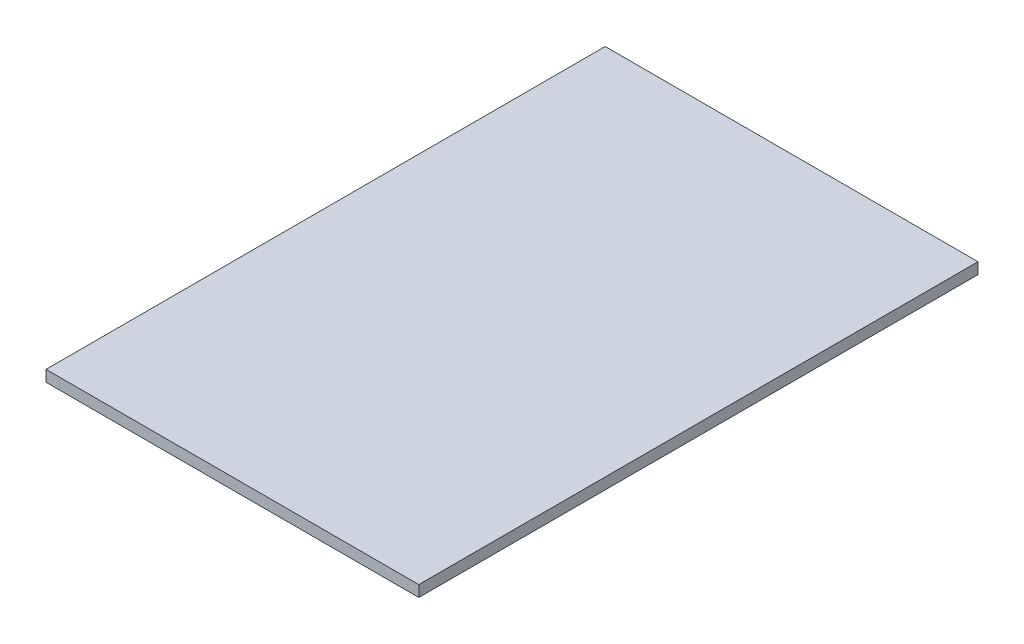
from build123d import *

# Parameters (mm, degrees)
ESQUISSE1_W        = 100
ESQUISSE1_H        = 150
BOSS_EXTRU_1_DEPTH = 3


with BuildPart() as part:
    # Esquisse1 → Boss.-Extru.1 (new body)
    with BuildSketch(Plane(origin=(0, 0, 0), x_dir=(1, 0, 0), z_dir=(0, 1, 0))):
        Rectangle(ESQUISSE1_W, ESQUISSE1_H)
    extrude(amount=BOSS_EXTRU_1_DEPTH)


solid = part.part
